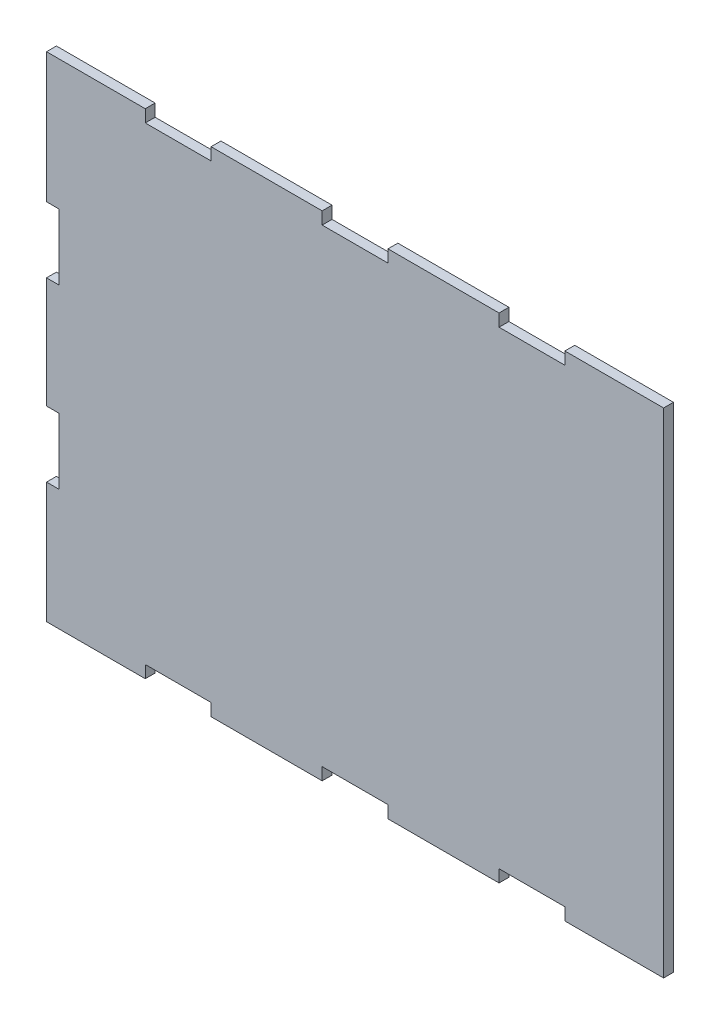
from build123d import *

# Parameters (mm, degrees)
SALIENTE_EXTRUIR1_DEPTH = 12


with BuildPart() as part:
    # Croquis1 → Saliente-Extruir1 (new body)
    with BuildSketch(Plane.XY):
        Polygon((375, -300), (255, -300), (255, -285), (175, -285), (175, -300), (40, -300), (40, -285), (-40, -285), (-40, -300), (-175, -300), (-175, -285), (-255, -285), (-255, -300), (-375, -300), (-375, -153), (-360, -153), (-360, -73), (-375, -73), (-375, 62), (-360, 62), (-360, 142), (-375, 142), (-375, 300), (-255, 300), (-255, 285), (-175, 285), (-175, 300), (-40, 300), (-40, 285), (40, 285), (40, 300), (175, 300), (175, 285), (255, 285), (255, 300), (375, 300), align=None)
    extrude(amount=SALIENTE_EXTRUIR1_DEPTH)


solid = part.part
